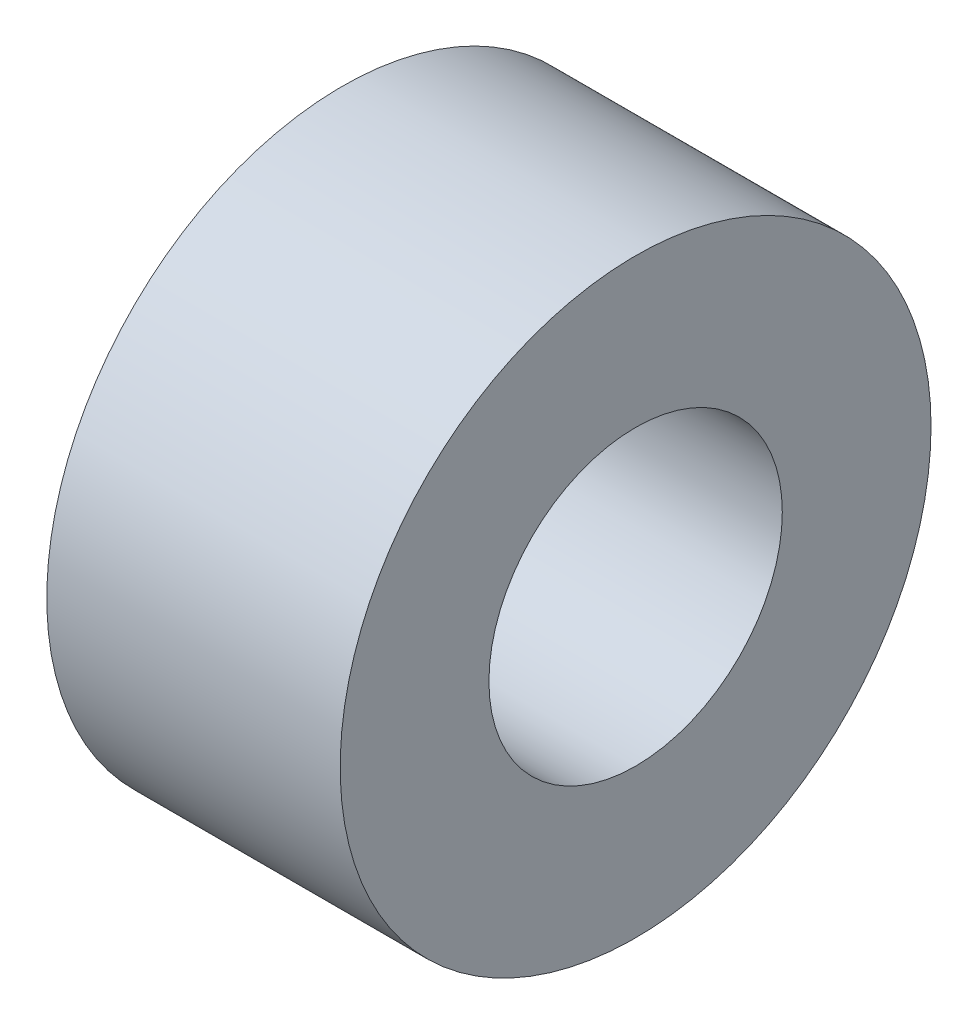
ISO-10303-21;
HEADER;
FILE_DESCRIPTION(('STEP AP214'),'2;1');
FILE_NAME('part.step','',(''),(''),'','','');
FILE_SCHEMA(('AUTOMOTIVE_DESIGN { 1 0 10303 214 1 1 1 1 }'));
ENDSEC;
DATA;
#1=APPLICATION_CONTEXT('core data for automotive mechanical design processes');
#2=APPLICATION_PROTOCOL_DEFINITION('international standard','automotive_design',2000,#1);
#3=PRODUCT_CONTEXT('',#1,'mechanical');
#4=PRODUCT('Part','Part','',(#3));
#5=PRODUCT_RELATED_PRODUCT_CATEGORY('part','',(#4));
#6=PRODUCT_DEFINITION_FORMATION('','',#4);
#7=PRODUCT_DEFINITION_CONTEXT('part definition',#1,'design');
#8=PRODUCT_DEFINITION('design','',#6,#7);
#9=PRODUCT_DEFINITION_SHAPE('','',#8);
#10=(LENGTH_UNIT() NAMED_UNIT(*) SI_UNIT(.MILLI.,.METRE.));
#11=(NAMED_UNIT(*) PLANE_ANGLE_UNIT() SI_UNIT($,.RADIAN.));
#12=(NAMED_UNIT(*) SI_UNIT($,.STERADIAN.) SOLID_ANGLE_UNIT());
#13=UNCERTAINTY_MEASURE_WITH_UNIT(LENGTH_MEASURE(1.E-05),#10,'distance_accuracy_value','');
#14=(GEOMETRIC_REPRESENTATION_CONTEXT(3) GLOBAL_UNCERTAINTY_ASSIGNED_CONTEXT((#13)) GLOBAL_UNIT_ASSIGNED_CONTEXT((#10,
#11,#12)) REPRESENTATION_CONTEXT('',''));
#15=CARTESIAN_POINT('',(0.,0.,0.));
#16=DIRECTION('',(0.,0.,1.));
#17=DIRECTION('',(1.,0.,0.));
#18=AXIS2_PLACEMENT_3D('',#15,#16,#17);
#19=CARTESIAN_POINT('',(7.29715980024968,0.,0.));
#20=DIRECTION('',(1.,0.,0.));
#21=DIRECTION('',(0.,0.,-1.));
#22=AXIS2_PLACEMENT_3D('',#19,#20,#21);
#23=CYLINDRICAL_SURFACE('',#22,25.57734082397);
#24=CARTESIAN_POINT('',(-25.7546816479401,0.,0.));
#25=DIRECTION('',(1.,0.,0.));
#26=DIRECTION('',(0.,0.,-1.));
#27=AXIS2_PLACEMENT_3D('',#24,#25,#26);
#28=CIRCLE('',#27,25.57734082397);
#29=CARTESIAN_POINT('',(-25.7546816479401,0.,-25.57734082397));
#30=VERTEX_POINT('',#29);
#31=EDGE_CURVE('E10',#30,#30,#28,.T.);
#32=ORIENTED_EDGE('',*,*,#31,.T.);
#33=EDGE_LOOP('',(#32));
#34=FACE_BOUND('',#33,.T.);
#35=CARTESIAN_POINT('',(-0.354681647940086,0.,0.));
#36=DIRECTION('',(1.,0.,0.));
#37=DIRECTION('',(0.,0.,-1.));
#38=AXIS2_PLACEMENT_3D('',#35,#36,#37);
#39=CIRCLE('',#38,25.57734082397);
#40=CARTESIAN_POINT('',(-0.354681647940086,0.,-25.57734082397));
#41=VERTEX_POINT('',#40);
#42=EDGE_CURVE('E47',#41,#41,#39,.T.);
#43=ORIENTED_EDGE('',*,*,#42,.F.);
#44=EDGE_LOOP('',(#43));
#45=FACE_BOUND('',#44,.T.);
#46=ADVANCED_FACE('F33',(#34,#45),#23,.T.);
#47=CARTESIAN_POINT('',(-25.7546816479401,25.57734082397,0.));
#48=DIRECTION('',(-1.,0.,0.));
#49=DIRECTION('',(0.,0.,1.));
#50=AXIS2_PLACEMENT_3D('',#47,#48,#49);
#51=PLANE('',#50);
#52=CARTESIAN_POINT('',(-25.7546816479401,0.,0.));
#53=DIRECTION('',(1.,0.,0.));
#54=DIRECTION('',(0.,0.,-1.));
#55=AXIS2_PLACEMENT_3D('',#52,#53,#54);
#56=CIRCLE('',#55,12.7);
#57=CARTESIAN_POINT('',(-25.7546816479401,0.,-12.7));
#58=VERTEX_POINT('',#57);
#59=EDGE_CURVE('E39',#58,#58,#56,.T.);
#60=ORIENTED_EDGE('',*,*,#59,.T.);
#61=EDGE_LOOP('',(#60));
#62=FACE_BOUND('',#61,.T.);
#63=ORIENTED_EDGE('',*,*,#31,.F.);
#64=EDGE_LOOP('',(#63));
#65=FACE_BOUND('',#64,.T.);
#66=ADVANCED_FACE('F57',(#62,#65),#51,.T.);
#67=CARTESIAN_POINT('',(7.29715980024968,0.,0.));
#68=DIRECTION('',(1.,0.,0.));
#69=DIRECTION('',(0.,0.,-1.));
#70=AXIS2_PLACEMENT_3D('',#67,#68,#69);
#71=CYLINDRICAL_SURFACE('',#70,12.7);
#72=CARTESIAN_POINT('',(-0.354681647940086,0.,0.));
#73=DIRECTION('',(1.,0.,0.));
#74=DIRECTION('',(0.,0.,-1.));
#75=AXIS2_PLACEMENT_3D('',#72,#73,#74);
#76=CIRCLE('',#75,12.7);
#77=CARTESIAN_POINT('',(-0.354681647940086,0.,-12.7));
#78=VERTEX_POINT('',#77);
#79=EDGE_CURVE('E43',#78,#78,#76,.T.);
#80=ORIENTED_EDGE('',*,*,#79,.T.);
#81=EDGE_LOOP('',(#80));
#82=FACE_BOUND('',#81,.T.);
#83=ORIENTED_EDGE('',*,*,#59,.F.);
#84=EDGE_LOOP('',(#83));
#85=FACE_BOUND('',#84,.T.);
#86=ADVANCED_FACE('F61',(#82,#85),#71,.F.);
#87=CARTESIAN_POINT('',(-0.354681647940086,12.7,0.));
#88=DIRECTION('',(1.,0.,0.));
#89=DIRECTION('',(0.,0.,-1.));
#90=AXIS2_PLACEMENT_3D('',#87,#88,#89);
#91=PLANE('',#90);
#92=ORIENTED_EDGE('',*,*,#42,.T.);
#93=EDGE_LOOP('',(#92));
#94=FACE_BOUND('',#93,.T.);
#95=ORIENTED_EDGE('',*,*,#79,.F.);
#96=EDGE_LOOP('',(#95));
#97=FACE_BOUND('',#96,.T.);
#98=ADVANCED_FACE('F53',(#94,#97),#91,.T.);
#99=CLOSED_SHELL('',(#46,#66,#86,#98));
#100=MANIFOLD_SOLID_BREP('B2',#99);
#101=ADVANCED_BREP_SHAPE_REPRESENTATION('',(#18,#100),#14);
#102=SHAPE_DEFINITION_REPRESENTATION(#9,#101);
ENDSEC;
END-ISO-10303-21;
